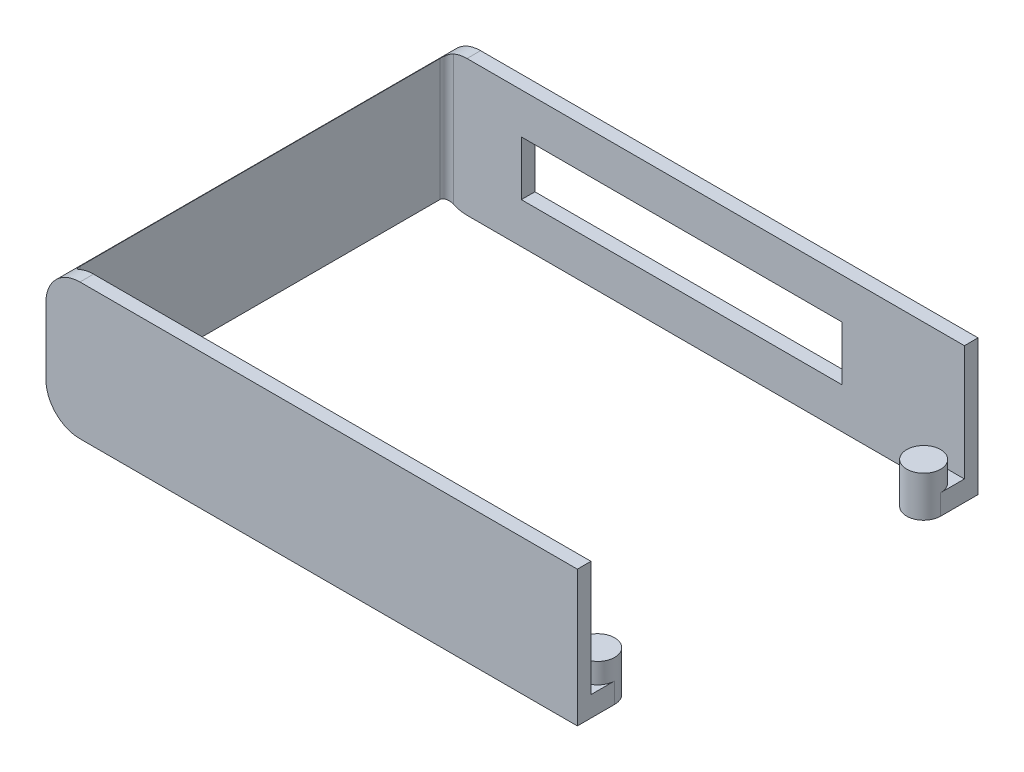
ISO-10303-21;
HEADER;
FILE_DESCRIPTION(('STEP AP214'),'2;1');
FILE_NAME('part.step','',(''),(''),'','','');
FILE_SCHEMA(('AUTOMOTIVE_DESIGN { 1 0 10303 214 1 1 1 1 }'));
ENDSEC;
DATA;
#1=APPLICATION_CONTEXT('core data for automotive mechanical design processes');
#2=APPLICATION_PROTOCOL_DEFINITION('international standard','automotive_design',2000,#1);
#3=PRODUCT_CONTEXT('',#1,'mechanical');
#4=PRODUCT('Part','Part','',(#3));
#5=PRODUCT_RELATED_PRODUCT_CATEGORY('part','',(#4));
#6=PRODUCT_DEFINITION_FORMATION('','',#4);
#7=PRODUCT_DEFINITION_CONTEXT('part definition',#1,'design');
#8=PRODUCT_DEFINITION('design','',#6,#7);
#9=PRODUCT_DEFINITION_SHAPE('','',#8);
#10=(LENGTH_UNIT() NAMED_UNIT(*) SI_UNIT(.MILLI.,.METRE.));
#11=(NAMED_UNIT(*) PLANE_ANGLE_UNIT() SI_UNIT($,.RADIAN.));
#12=(NAMED_UNIT(*) SI_UNIT($,.STERADIAN.) SOLID_ANGLE_UNIT());
#13=UNCERTAINTY_MEASURE_WITH_UNIT(LENGTH_MEASURE(1.E-05),#10,'distance_accuracy_value','');
#14=(GEOMETRIC_REPRESENTATION_CONTEXT(3) GLOBAL_UNCERTAINTY_ASSIGNED_CONTEXT((#13)) GLOBAL_UNIT_ASSIGNED_CONTEXT((#10,
#11,#12)) REPRESENTATION_CONTEXT('',''));
#15=CARTESIAN_POINT('',(0.,0.,0.));
#16=DIRECTION('',(0.,0.,1.));
#17=DIRECTION('',(1.,0.,0.));
#18=AXIS2_PLACEMENT_3D('',#15,#16,#17);
#19=CARTESIAN_POINT('',(-39.125,0.,2.));
#20=DIRECTION('',(0.,1.,0.));
#21=DIRECTION('',(0.,0.,1.));
#22=AXIS2_PLACEMENT_3D('',#19,#20,#21);
#23=PLANE('',#22);
#24=DIRECTION('',(1.,0.,0.));
#25=VECTOR('',#24,1.);
#26=CARTESIAN_POINT('',(-39.125,0.,59.));
#27=LINE('',#26,#25);
#28=CARTESIAN_POINT('',(-34.125,0.,59.));
#29=VERTEX_POINT('',#28);
#30=CARTESIAN_POINT('',(39.125,0.,59.));
#31=VERTEX_POINT('',#30);
#32=EDGE_CURVE('E416',#29,#31,#27,.T.);
#33=ORIENTED_EDGE('',*,*,#32,.F.);
#34=DIRECTION('',(0.,0.,-1.));
#35=VECTOR('',#34,1.);
#36=CARTESIAN_POINT('',(-34.125,0.,2.));
#37=LINE('',#36,#35);
#38=CARTESIAN_POINT('',(-34.125,0.,57.));
#39=VERTEX_POINT('',#38);
#40=EDGE_CURVE('E270',#29,#39,#37,.T.);
#41=ORIENTED_EDGE('',*,*,#40,.T.);
#42=DIRECTION('',(1.,0.,0.));
#43=VECTOR('',#42,1.);
#44=CARTESIAN_POINT('',(-39.125,0.,57.));
#45=LINE('',#44,#43);
#46=CARTESIAN_POINT('',(34.125,0.,57.));
#47=VERTEX_POINT('',#46);
#48=EDGE_CURVE('E249',#39,#47,#45,.T.);
#49=ORIENTED_EDGE('',*,*,#48,.T.);
#50=DIRECTION('',(0.,0.,-1.));
#51=VECTOR('',#50,1.);
#52=CARTESIAN_POINT('',(34.125,0.,59.));
#53=LINE('',#52,#51);
#54=CARTESIAN_POINT('',(34.125,0.,53.5));
#55=VERTEX_POINT('',#54);
#56=EDGE_CURVE('E235',#47,#55,#53,.T.);
#57=ORIENTED_EDGE('',*,*,#56,.T.);
#58=CARTESIAN_POINT('',(36.625,0.,53.5));
#59=DIRECTION('',(0.,-1.,0.));
#60=DIRECTION('',(0.,0.,1.));
#61=AXIS2_PLACEMENT_3D('',#58,#59,#60);
#62=CIRCLE('',#61,2.5);
#63=CARTESIAN_POINT('',(39.125,0.,53.5));
#64=VERTEX_POINT('',#63);
#65=EDGE_CURVE('E232',#55,#64,#62,.T.);
#66=ORIENTED_EDGE('',*,*,#65,.T.);
#67=DIRECTION('',(0.,0.,-1.));
#68=VECTOR('',#67,1.);
#69=CARTESIAN_POINT('',(39.125,0.,59.));
#70=LINE('',#69,#68);
#71=EDGE_CURVE('E443',#31,#64,#70,.T.);
#72=ORIENTED_EDGE('',*,*,#71,.F.);
#73=EDGE_LOOP('',(#33,#41,#49,#57,#66,#72));
#74=FACE_BOUND('',#73,.T.);
#75=ADVANCED_FACE('F26',(#74),#23,.F.);
#76=CARTESIAN_POINT('',(-39.125,20.,2.));
#77=DIRECTION('',(0.,-1.,0.));
#78=DIRECTION('',(1.,0.,0.));
#79=AXIS2_PLACEMENT_3D('',#76,#77,#78);
#80=PLANE('',#79);
#81=DIRECTION('',(-1.,0.,0.));
#82=VECTOR('',#81,1.);
#83=CARTESIAN_POINT('',(-39.125,20.,0.));
#84=LINE('',#83,#82);
#85=CARTESIAN_POINT('',(39.125,20.,0.));
#86=VERTEX_POINT('',#85);
#87=CARTESIAN_POINT('',(-34.125,20.,0.));
#88=VERTEX_POINT('',#87);
#89=EDGE_CURVE('E362',#86,#88,#84,.T.);
#90=ORIENTED_EDGE('',*,*,#89,.T.);
#91=DIRECTION('',(0.,0.,-1.));
#92=VECTOR('',#91,1.);
#93=CARTESIAN_POINT('',(-34.125,20.,2.));
#94=LINE('',#93,#92);
#95=CARTESIAN_POINT('',(-34.125,20.,2.));
#96=VERTEX_POINT('',#95);
#97=EDGE_CURVE('E385',#88,#96,#94,.F.);
#98=ORIENTED_EDGE('',*,*,#97,.T.);
#99=DIRECTION('',(-1.,0.,0.));
#100=VECTOR('',#99,1.);
#101=CARTESIAN_POINT('',(-39.125,20.,2.));
#102=LINE('',#101,#100);
#103=CARTESIAN_POINT('',(39.125,20.,2.));
#104=VERTEX_POINT('',#103);
#105=EDGE_CURVE('E394',#104,#96,#102,.T.);
#106=ORIENTED_EDGE('',*,*,#105,.F.);
#107=DIRECTION('',(0.,0.,-1.));
#108=VECTOR('',#107,1.);
#109=CARTESIAN_POINT('',(39.125,20.,2.));
#110=LINE('',#109,#108);
#111=EDGE_CURVE('E397',#104,#86,#110,.T.);
#112=ORIENTED_EDGE('',*,*,#111,.T.);
#113=EDGE_LOOP('',(#90,#98,#106,#112));
#114=FACE_BOUND('',#113,.T.);
#115=ADVANCED_FACE('F328',(#114),#80,.F.);
#116=CARTESIAN_POINT('',(36.625,3.,5.5));
#117=DIRECTION('',(0.,-1.,0.));
#118=DIRECTION('',(0.,0.,-1.));
#119=AXIS2_PLACEMENT_3D('',#116,#117,#118);
#120=PLANE('',#119);
#121=CARTESIAN_POINT('',(36.625,3.,5.5));
#122=DIRECTION('',(0.,1.,0.));
#123=DIRECTION('',(0.,0.,1.));
#124=AXIS2_PLACEMENT_3D('',#121,#122,#123);
#125=CIRCLE('',#124,2.5);
#126=CARTESIAN_POINT('',(39.125,3.,5.5));
#127=VERTEX_POINT('',#126);
#128=CARTESIAN_POINT('',(34.125,3.,5.5));
#129=VERTEX_POINT('',#128);
#130=EDGE_CURVE('E446',#127,#129,#125,.T.);
#131=ORIENTED_EDGE('',*,*,#130,.F.);
#132=DIRECTION('',(0.,0.,-1.));
#133=VECTOR('',#132,1.);
#134=CARTESIAN_POINT('',(39.125,3.,0.));
#135=LINE('',#134,#133);
#136=CARTESIAN_POINT('',(39.125,3.,2.));
#137=VERTEX_POINT('',#136);
#138=EDGE_CURVE('E721',#127,#137,#135,.T.);
#139=ORIENTED_EDGE('',*,*,#138,.T.);
#140=DIRECTION('',(1.,0.,0.));
#141=VECTOR('',#140,1.);
#142=CARTESIAN_POINT('',(-39.125,3.,2.));
#143=LINE('',#142,#141);
#144=CARTESIAN_POINT('',(34.125,3.,2.));
#145=VERTEX_POINT('',#144);
#146=EDGE_CURVE('E475',#145,#137,#143,.T.);
#147=ORIENTED_EDGE('',*,*,#146,.F.);
#148=DIRECTION('',(0.,0.,1.));
#149=VECTOR('',#148,1.);
#150=CARTESIAN_POINT('',(34.125,3.,0.));
#151=LINE('',#150,#149);
#152=EDGE_CURVE('E724',#145,#129,#151,.T.);
#153=ORIENTED_EDGE('',*,*,#152,.T.);
#154=EDGE_LOOP('',(#131,#139,#147,#153));
#155=FACE_BOUND('',#154,.T.);
#156=ADVANCED_FACE('F335',(#155),#120,.F.);
#157=CARTESIAN_POINT('',(-39.125,0.,2.));
#158=DIRECTION('',(0.,0.,1.));
#159=DIRECTION('',(1.,0.,0.));
#160=AXIS2_PLACEMENT_3D('',#157,#158,#159);
#161=PLANE('',#160);
#162=DIRECTION('',(0.,-1.,0.));
#163=VECTOR('',#162,1.);
#164=CARTESIAN_POINT('',(21.124999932,14.,2.));
#165=LINE('',#164,#163);
#166=CARTESIAN_POINT('',(21.124999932,14.,2.));
#167=VERTEX_POINT('',#166);
#168=CARTESIAN_POINT('',(21.124999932,5.99999999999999,2.));
#169=VERTEX_POINT('',#168);
#170=EDGE_CURVE('E194',#167,#169,#165,.T.);
#171=ORIENTED_EDGE('',*,*,#170,.T.);
#172=DIRECTION('',(-1.,0.,0.));
#173=VECTOR('',#172,1.);
#174=CARTESIAN_POINT('',(21.124999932,5.99999999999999,2.));
#175=LINE('',#174,#173);
#176=CARTESIAN_POINT('',(-26.125,5.99999999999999,2.));
#177=VERTEX_POINT('',#176);
#178=EDGE_CURVE('E217',#169,#177,#175,.T.);
#179=ORIENTED_EDGE('',*,*,#178,.T.);
#180=DIRECTION('',(0.,1.,0.));
#181=VECTOR('',#180,1.);
#182=CARTESIAN_POINT('',(-26.125,14.,2.));
#183=LINE('',#182,#181);
#184=CARTESIAN_POINT('',(-26.125,14.,2.));
#185=VERTEX_POINT('',#184);
#186=EDGE_CURVE('E197',#177,#185,#183,.T.);
#187=ORIENTED_EDGE('',*,*,#186,.T.);
#188=DIRECTION('',(1.,0.,0.));
#189=VECTOR('',#188,1.);
#190=CARTESIAN_POINT('',(21.124999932,14.,2.));
#191=LINE('',#190,#189);
#192=EDGE_CURVE('E198',#185,#167,#191,.T.);
#193=ORIENTED_EDGE('',*,*,#192,.T.);
#194=EDGE_LOOP('',(#171,#179,#187,#193));
#195=FACE_BOUND('',#194,.T.);
#196=CARTESIAN_POINT('',(-34.125,15.,2.));
#197=DIRECTION('',(0.,0.,1.));
#198=DIRECTION('',(1.,0.,0.));
#199=AXIS2_PLACEMENT_3D('',#196,#197,#198);
#200=CIRCLE('',#199,5.);
#201=CARTESIAN_POINT('',(-36.125,19.5825756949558,2.));
#202=VERTEX_POINT('',#201);
#203=EDGE_CURVE('E484',#96,#202,#200,.T.);
#204=ORIENTED_EDGE('',*,*,#203,.T.);
#205=DIRECTION('',(0.,1.,0.));
#206=VECTOR('',#205,1.);
#207=CARTESIAN_POINT('',(-36.125,0.,2.));
#208=LINE('',#207,#206);
#209=CARTESIAN_POINT('',(-36.125,0.417424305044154,2.));
#210=VERTEX_POINT('',#209);
#211=EDGE_CURVE('E281',#202,#210,#208,.F.);
#212=ORIENTED_EDGE('',*,*,#211,.T.);
#213=CARTESIAN_POINT('',(-34.125,5.,2.));
#214=DIRECTION('',(0.,0.,1.));
#215=DIRECTION('',(1.,0.,0.));
#216=AXIS2_PLACEMENT_3D('',#213,#214,#215);
#217=CIRCLE('',#216,5.);
#218=CARTESIAN_POINT('',(-34.125,0.,2.));
#219=VERTEX_POINT('',#218);
#220=EDGE_CURVE('E368',#210,#219,#217,.T.);
#221=ORIENTED_EDGE('',*,*,#220,.T.);
#222=DIRECTION('',(1.,0.,0.));
#223=VECTOR('',#222,1.);
#224=CARTESIAN_POINT('',(-39.125,0.,2.));
#225=LINE('',#224,#223);
#226=CARTESIAN_POINT('',(34.125,0.,2.));
#227=VERTEX_POINT('',#226);
#228=EDGE_CURVE('E354',#219,#227,#225,.T.);
#229=ORIENTED_EDGE('',*,*,#228,.T.);
#230=DIRECTION('',(0.,1.,0.));
#231=VECTOR('',#230,1.);
#232=CARTESIAN_POINT('',(34.125,0.,2.));
#233=LINE('',#232,#231);
#234=EDGE_CURVE('E471',#227,#145,#233,.T.);
#235=ORIENTED_EDGE('',*,*,#234,.T.);
#236=ORIENTED_EDGE('',*,*,#146,.T.);
#237=DIRECTION('',(0.,1.,0.));
#238=VECTOR('',#237,1.);
#239=CARTESIAN_POINT('',(39.125,20.,2.));
#240=LINE('',#239,#238);
#241=EDGE_CURVE('E361',#137,#104,#240,.T.);
#242=ORIENTED_EDGE('',*,*,#241,.T.);
#243=ORIENTED_EDGE('',*,*,#105,.T.);
#244=EDGE_LOOP('',(#204,#212,#221,#229,#235,#236,#242,#243));
#245=FACE_BOUND('',#244,.T.);
#246=ADVANCED_FACE('F350',(#195,#245),#161,.T.);
#247=CARTESIAN_POINT('',(-39.125,20.,2.));
#248=DIRECTION('',(1.,0.,0.));
#249=DIRECTION('',(0.,1.,0.));
#250=AXIS2_PLACEMENT_3D('',#247,#248,#249);
#251=PLANE('',#250);
#252=DIRECTION('',(0.,-1.,0.));
#253=VECTOR('',#252,1.);
#254=CARTESIAN_POINT('',(-39.125,0.,59.));
#255=LINE('',#254,#253);
#256=CARTESIAN_POINT('',(-39.125,15.,59.));
#257=VERTEX_POINT('',#256);
#258=CARTESIAN_POINT('',(-39.125,5.,59.));
#259=VERTEX_POINT('',#258);
#260=EDGE_CURVE('E409',#257,#259,#255,.T.);
#261=ORIENTED_EDGE('',*,*,#260,.F.);
#262=DIRECTION('',(0.,0.,-1.));
#263=VECTOR('',#262,1.);
#264=CARTESIAN_POINT('',(-39.125,15.,2.));
#265=LINE('',#264,#263);
#266=CARTESIAN_POINT('',(-39.125,15.,0.));
#267=VERTEX_POINT('',#266);
#268=EDGE_CURVE('E376',#257,#267,#265,.T.);
#269=ORIENTED_EDGE('',*,*,#268,.T.);
#270=DIRECTION('',(0.,-1.,0.));
#271=VECTOR('',#270,1.);
#272=CARTESIAN_POINT('',(-39.125,20.,0.));
#273=LINE('',#272,#271);
#274=CARTESIAN_POINT('',(-39.125,5.,0.));
#275=VERTEX_POINT('',#274);
#276=EDGE_CURVE('E411',#267,#275,#273,.T.);
#277=ORIENTED_EDGE('',*,*,#276,.T.);
#278=DIRECTION('',(0.,0.,-1.));
#279=VECTOR('',#278,1.);
#280=CARTESIAN_POINT('',(-39.125,5.,2.));
#281=LINE('',#280,#279);
#282=EDGE_CURVE('E372',#275,#259,#281,.F.);
#283=ORIENTED_EDGE('',*,*,#282,.T.);
#284=EDGE_LOOP('',(#261,#269,#277,#283));
#285=FACE_BOUND('',#284,.T.);
#286=ADVANCED_FACE('F28',(#285),#251,.F.);
#287=ORIENTED_EDGE('',*,*,#228,.F.);
#288=DIRECTION('',(0.,0.,-1.));
#289=VECTOR('',#288,1.);
#290=CARTESIAN_POINT('',(-34.125,0.,2.));
#291=LINE('',#290,#289);
#292=CARTESIAN_POINT('',(-34.125,0.,0.));
#293=VERTEX_POINT('',#292);
#294=EDGE_CURVE('E268',#219,#293,#291,.T.);
#295=ORIENTED_EDGE('',*,*,#294,.T.);
#296=DIRECTION('',(1.,0.,0.));
#297=VECTOR('',#296,1.);
#298=CARTESIAN_POINT('',(-39.125,0.,0.));
#299=LINE('',#298,#297);
#300=CARTESIAN_POINT('',(39.125,0.,0.));
#301=VERTEX_POINT('',#300);
#302=EDGE_CURVE('E470',#293,#301,#299,.T.);
#303=ORIENTED_EDGE('',*,*,#302,.T.);
#304=DIRECTION('',(0.,0.,-1.));
#305=VECTOR('',#304,1.);
#306=CARTESIAN_POINT('',(39.125,0.,2.));
#307=LINE('',#306,#305);
#308=CARTESIAN_POINT('',(39.125,0.,5.5));
#309=VERTEX_POINT('',#308);
#310=EDGE_CURVE('E402',#309,#301,#307,.T.);
#311=ORIENTED_EDGE('',*,*,#310,.F.);
#312=CARTESIAN_POINT('',(36.625,0.,5.5));
#313=DIRECTION('',(0.,1.,0.));
#314=DIRECTION('',(0.,0.,-1.));
#315=AXIS2_PLACEMENT_3D('',#312,#313,#314);
#316=CIRCLE('',#315,2.5);
#317=CARTESIAN_POINT('',(34.125,0.,5.5));
#318=VERTEX_POINT('',#317);
#319=EDGE_CURVE('E716',#318,#309,#316,.T.);
#320=ORIENTED_EDGE('',*,*,#319,.F.);
#321=DIRECTION('',(0.,0.,1.));
#322=VECTOR('',#321,1.);
#323=CARTESIAN_POINT('',(34.125,0.,0.));
#324=LINE('',#323,#322);
#325=EDGE_CURVE('E358',#227,#318,#324,.T.);
#326=ORIENTED_EDGE('',*,*,#325,.F.);
#327=EDGE_LOOP('',(#287,#295,#303,#311,#320,#326));
#328=FACE_BOUND('',#327,.T.);
#329=ADVANCED_FACE('F330',(#328),#23,.F.);
#330=CARTESIAN_POINT('',(39.125,20.,2.));
#331=DIRECTION('',(-1.,0.,0.));
#332=DIRECTION('',(0.,0.,1.));
#333=AXIS2_PLACEMENT_3D('',#330,#331,#332);
#334=PLANE('',#333);
#335=DIRECTION('',(0.,1.,0.));
#336=VECTOR('',#335,1.);
#337=CARTESIAN_POINT('',(39.125,20.,0.));
#338=LINE('',#337,#336);
#339=EDGE_CURVE('E473',#301,#86,#338,.T.);
#340=ORIENTED_EDGE('',*,*,#339,.T.);
#341=ORIENTED_EDGE('',*,*,#111,.F.);
#342=ORIENTED_EDGE('',*,*,#241,.F.);
#343=ORIENTED_EDGE('',*,*,#138,.F.);
#344=DIRECTION('',(0.,-1.,0.));
#345=VECTOR('',#344,1.);
#346=CARTESIAN_POINT('',(39.125,3.,5.5));
#347=LINE('',#346,#345);
#348=EDGE_CURVE('E727',#127,#309,#347,.T.);
#349=ORIENTED_EDGE('',*,*,#348,.T.);
#350=ORIENTED_EDGE('',*,*,#310,.T.);
#351=EDGE_LOOP('',(#340,#341,#342,#343,#349,#350));
#352=FACE_BOUND('',#351,.T.);
#353=ADVANCED_FACE('F342',(#352),#334,.F.);
#354=DIRECTION('',(-1.,0.,0.));
#355=VECTOR('',#354,1.);
#356=CARTESIAN_POINT('',(-39.125,20.,57.));
#357=LINE('',#356,#355);
#358=CARTESIAN_POINT('',(39.125,20.,57.));
#359=VERTEX_POINT('',#358);
#360=CARTESIAN_POINT('',(-34.125,20.,57.));
#361=VERTEX_POINT('',#360);
#362=EDGE_CURVE('E417',#359,#361,#357,.T.);
#363=ORIENTED_EDGE('',*,*,#362,.T.);
#364=DIRECTION('',(0.,0.,-1.));
#365=VECTOR('',#364,1.);
#366=CARTESIAN_POINT('',(-34.125,20.,2.));
#367=LINE('',#366,#365);
#368=CARTESIAN_POINT('',(-34.125,20.,59.));
#369=VERTEX_POINT('',#368);
#370=EDGE_CURVE('E378',#361,#369,#367,.F.);
#371=ORIENTED_EDGE('',*,*,#370,.T.);
#372=DIRECTION('',(-1.,0.,0.));
#373=VECTOR('',#372,1.);
#374=CARTESIAN_POINT('',(-39.125,20.,59.));
#375=LINE('',#374,#373);
#376=CARTESIAN_POINT('',(39.125,20.,59.));
#377=VERTEX_POINT('',#376);
#378=EDGE_CURVE('E453',#377,#369,#375,.T.);
#379=ORIENTED_EDGE('',*,*,#378,.F.);
#380=DIRECTION('',(0.,0.,-1.));
#381=VECTOR('',#380,1.);
#382=CARTESIAN_POINT('',(39.125,20.,59.));
#383=LINE('',#382,#381);
#384=EDGE_CURVE('E447',#377,#359,#383,.T.);
#385=ORIENTED_EDGE('',*,*,#384,.T.);
#386=EDGE_LOOP('',(#363,#371,#379,#385));
#387=FACE_BOUND('',#386,.T.);
#388=ADVANCED_FACE('F338',(#387),#80,.F.);
#389=CARTESIAN_POINT('',(-39.125,0.,0.));
#390=DIRECTION('',(0.,0.,1.));
#391=DIRECTION('',(1.,0.,0.));
#392=AXIS2_PLACEMENT_3D('',#389,#390,#391);
#393=PLANE('',#392);
#394=DIRECTION('',(-1.,0.,0.));
#395=VECTOR('',#394,1.);
#396=CARTESIAN_POINT('',(21.124999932,5.99999999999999,0.));
#397=LINE('',#396,#395);
#398=CARTESIAN_POINT('',(21.124999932,5.99999999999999,0.));
#399=VERTEX_POINT('',#398);
#400=CARTESIAN_POINT('',(-26.125,5.99999999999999,0.));
#401=VERTEX_POINT('',#400);
#402=EDGE_CURVE('E214',#399,#401,#397,.T.);
#403=ORIENTED_EDGE('',*,*,#402,.F.);
#404=DIRECTION('',(0.,-1.,0.));
#405=VECTOR('',#404,1.);
#406=CARTESIAN_POINT('',(21.124999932,14.,0.));
#407=LINE('',#406,#405);
#408=CARTESIAN_POINT('',(21.124999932,14.,0.));
#409=VERTEX_POINT('',#408);
#410=EDGE_CURVE('E54',#409,#399,#407,.T.);
#411=ORIENTED_EDGE('',*,*,#410,.F.);
#412=DIRECTION('',(1.,0.,0.));
#413=VECTOR('',#412,1.);
#414=CARTESIAN_POINT('',(21.124999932,14.,0.));
#415=LINE('',#414,#413);
#416=CARTESIAN_POINT('',(-26.125,14.,0.));
#417=VERTEX_POINT('',#416);
#418=EDGE_CURVE('E201',#417,#409,#415,.T.);
#419=ORIENTED_EDGE('',*,*,#418,.F.);
#420=DIRECTION('',(0.,1.,0.));
#421=VECTOR('',#420,1.);
#422=CARTESIAN_POINT('',(-26.125,14.,0.));
#423=LINE('',#422,#421);
#424=EDGE_CURVE('E209',#401,#417,#423,.T.);
#425=ORIENTED_EDGE('',*,*,#424,.F.);
#426=EDGE_LOOP('',(#403,#411,#419,#425));
#427=FACE_BOUND('',#426,.T.);
#428=ORIENTED_EDGE('',*,*,#276,.F.);
#429=CARTESIAN_POINT('',(-34.125,15.,0.));
#430=DIRECTION('',(0.,0.,1.));
#431=DIRECTION('',(1.,0.,0.));
#432=AXIS2_PLACEMENT_3D('',#429,#430,#431);
#433=CIRCLE('',#432,5.);
#434=EDGE_CURVE('E375',#267,#88,#433,.F.);
#435=ORIENTED_EDGE('',*,*,#434,.T.);
#436=ORIENTED_EDGE('',*,*,#89,.F.);
#437=ORIENTED_EDGE('',*,*,#339,.F.);
#438=ORIENTED_EDGE('',*,*,#302,.F.);
#439=CARTESIAN_POINT('',(-34.125,5.,0.));
#440=DIRECTION('',(0.,0.,1.));
#441=DIRECTION('',(1.,0.,0.));
#442=AXIS2_PLACEMENT_3D('',#439,#440,#441);
#443=CIRCLE('',#442,5.);
#444=EDGE_CURVE('E371',#293,#275,#443,.F.);
#445=ORIENTED_EDGE('',*,*,#444,.T.);
#446=EDGE_LOOP('',(#428,#435,#436,#437,#438,#445));
#447=FACE_BOUND('',#446,.T.);
#448=ADVANCED_FACE('F212',(#427,#447),#393,.F.);
#449=CARTESIAN_POINT('',(-37.125,20.,29.5));
#450=DIRECTION('',(-1.,0.,0.));
#451=DIRECTION('',(0.,0.,1.));
#452=AXIS2_PLACEMENT_3D('',#449,#450,#451);
#453=PLANE('',#452);
#454=DIRECTION('',(0.,0.,-1.));
#455=VECTOR('',#454,1.);
#456=CARTESIAN_POINT('',(-37.125,19.,2.));
#457=LINE('',#456,#455);
#458=CARTESIAN_POINT('',(-37.125,19.,3.));
#459=VERTEX_POINT('',#458);
#460=CARTESIAN_POINT('',(-37.125,19.,56.));
#461=VERTEX_POINT('',#460);
#462=EDGE_CURVE('E257',#459,#461,#457,.F.);
#463=ORIENTED_EDGE('',*,*,#462,.T.);
#464=DIRECTION('',(0.,1.,0.));
#465=VECTOR('',#464,1.);
#466=CARTESIAN_POINT('',(-37.125,20.,56.));
#467=LINE('',#466,#465);
#468=CARTESIAN_POINT('',(-37.125,0.999999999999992,56.));
#469=VERTEX_POINT('',#468);
#470=EDGE_CURVE('E279',#461,#469,#467,.F.);
#471=ORIENTED_EDGE('',*,*,#470,.T.);
#472=DIRECTION('',(0.,0.,-1.));
#473=VECTOR('',#472,1.);
#474=CARTESIAN_POINT('',(-37.125,0.999999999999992,57.));
#475=LINE('',#474,#473);
#476=CARTESIAN_POINT('',(-37.125,0.999999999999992,3.));
#477=VERTEX_POINT('',#476);
#478=EDGE_CURVE('E487',#469,#477,#475,.T.);
#479=ORIENTED_EDGE('',*,*,#478,.T.);
#480=DIRECTION('',(0.,1.,0.));
#481=VECTOR('',#480,1.);
#482=CARTESIAN_POINT('',(-37.125,20.,3.));
#483=LINE('',#482,#481);
#484=EDGE_CURVE('E276',#477,#459,#483,.T.);
#485=ORIENTED_EDGE('',*,*,#484,.T.);
#486=EDGE_LOOP('',(#463,#471,#479,#485));
#487=FACE_BOUND('',#486,.T.);
#488=ADVANCED_FACE('F494',(#487),#453,.F.);
#489=CARTESIAN_POINT('',(34.125,3.,0.));
#490=DIRECTION('',(1.,0.,0.));
#491=DIRECTION('',(0.,0.,-1.));
#492=AXIS2_PLACEMENT_3D('',#489,#490,#491);
#493=PLANE('',#492);
#494=ORIENTED_EDGE('',*,*,#234,.F.);
#495=ORIENTED_EDGE('',*,*,#325,.T.);
#496=DIRECTION('',(0.,-1.,0.));
#497=VECTOR('',#496,1.);
#498=CARTESIAN_POINT('',(34.125,3.,5.5));
#499=LINE('',#498,#497);
#500=EDGE_CURVE('E730',#129,#318,#499,.T.);
#501=ORIENTED_EDGE('',*,*,#500,.F.);
#502=ORIENTED_EDGE('',*,*,#152,.F.);
#503=EDGE_LOOP('',(#494,#495,#501,#502));
#504=FACE_BOUND('',#503,.T.);
#505=ADVANCED_FACE('F509',(#504),#493,.F.);
#506=CARTESIAN_POINT('',(36.625,3.,5.5));
#507=DIRECTION('',(0.,-1.,0.));
#508=DIRECTION('',(0.,0.,-1.));
#509=AXIS2_PLACEMENT_3D('',#506,#507,#508);
#510=CYLINDRICAL_SURFACE('',#509,2.5);
#511=ORIENTED_EDGE('',*,*,#319,.T.);
#512=ORIENTED_EDGE('',*,*,#348,.F.);
#513=ORIENTED_EDGE('',*,*,#130,.T.);
#514=ORIENTED_EDGE('',*,*,#500,.T.);
#515=EDGE_LOOP('',(#511,#512,#513,#514));
#516=FACE_BOUND('',#515,.T.);
#517=CARTESIAN_POINT('',(36.625,6.,5.5));
#518=DIRECTION('',(0.,1.,0.));
#519=DIRECTION('',(0.,0.,1.));
#520=AXIS2_PLACEMENT_3D('',#517,#518,#519);
#521=CIRCLE('',#520,2.5);
#522=CARTESIAN_POINT('',(36.625,6.,8.));
#523=VERTEX_POINT('',#522);
#524=EDGE_CURVE('E450',#523,#523,#521,.T.);
#525=ORIENTED_EDGE('',*,*,#524,.F.);
#526=EDGE_LOOP('',(#525));
#527=FACE_BOUND('',#526,.T.);
#528=ADVANCED_FACE('F512',(#516,#527),#510,.T.);
#529=CARTESIAN_POINT('',(36.625,6.,5.5));
#530=DIRECTION('',(0.,1.,0.));
#531=DIRECTION('',(0.,0.,1.));
#532=AXIS2_PLACEMENT_3D('',#529,#530,#531);
#533=PLANE('',#532);
#534=ORIENTED_EDGE('',*,*,#524,.T.);
#535=EDGE_LOOP('',(#534));
#536=FACE_BOUND('',#535,.T.);
#537=ADVANCED_FACE('F516',(#536),#533,.T.);
#538=CARTESIAN_POINT('',(39.125,0.,59.));
#539=DIRECTION('',(-1.,0.,0.));
#540=DIRECTION('',(0.,0.,1.));
#541=AXIS2_PLACEMENT_3D('',#538,#539,#540);
#542=PLANE('',#541);
#543=ORIENTED_EDGE('',*,*,#71,.T.);
#544=DIRECTION('',(0.,-1.,0.));
#545=VECTOR('',#544,1.);
#546=CARTESIAN_POINT('',(39.125,3.,53.5));
#547=LINE('',#546,#545);
#548=CARTESIAN_POINT('',(39.125,3.,53.5));
#549=VERTEX_POINT('',#548);
#550=EDGE_CURVE('E246',#549,#64,#547,.T.);
#551=ORIENTED_EDGE('',*,*,#550,.F.);
#552=DIRECTION('',(0.,0.,1.));
#553=VECTOR('',#552,1.);
#554=CARTESIAN_POINT('',(39.125,3.,59.));
#555=LINE('',#554,#553);
#556=CARTESIAN_POINT('',(39.125,3.,57.));
#557=VERTEX_POINT('',#556);
#558=EDGE_CURVE('E237',#549,#557,#555,.T.);
#559=ORIENTED_EDGE('',*,*,#558,.T.);
#560=DIRECTION('',(0.,1.,0.));
#561=VECTOR('',#560,1.);
#562=CARTESIAN_POINT('',(39.125,0.,57.));
#563=LINE('',#562,#561);
#564=EDGE_CURVE('E252',#557,#359,#563,.T.);
#565=ORIENTED_EDGE('',*,*,#564,.T.);
#566=ORIENTED_EDGE('',*,*,#384,.F.);
#567=DIRECTION('',(0.,1.,0.));
#568=VECTOR('',#567,1.);
#569=CARTESIAN_POINT('',(39.125,0.,59.));
#570=LINE('',#569,#568);
#571=EDGE_CURVE('E445',#31,#377,#570,.T.);
#572=ORIENTED_EDGE('',*,*,#571,.F.);
#573=EDGE_LOOP('',(#543,#551,#559,#565,#566,#572));
#574=FACE_BOUND('',#573,.T.);
#575=ADVANCED_FACE('F441',(#574),#542,.F.);
#576=CARTESIAN_POINT('',(-39.125,20.,59.));
#577=DIRECTION('',(0.,0.,-1.));
#578=DIRECTION('',(-1.,0.,0.));
#579=AXIS2_PLACEMENT_3D('',#576,#577,#578);
#580=PLANE('',#579);
#581=ORIENTED_EDGE('',*,*,#378,.T.);
#582=CARTESIAN_POINT('',(-34.125,15.,59.));
#583=DIRECTION('',(0.,0.,-1.));
#584=DIRECTION('',(-1.,0.,0.));
#585=AXIS2_PLACEMENT_3D('',#582,#583,#584);
#586=CIRCLE('',#585,5.);
#587=EDGE_CURVE('E266',#369,#257,#586,.F.);
#588=ORIENTED_EDGE('',*,*,#587,.T.);
#589=ORIENTED_EDGE('',*,*,#260,.T.);
#590=CARTESIAN_POINT('',(-34.125,5.,59.));
#591=DIRECTION('',(0.,0.,-1.));
#592=DIRECTION('',(-1.,0.,0.));
#593=AXIS2_PLACEMENT_3D('',#590,#591,#592);
#594=CIRCLE('',#593,5.);
#595=EDGE_CURVE('E264',#259,#29,#594,.F.);
#596=ORIENTED_EDGE('',*,*,#595,.T.);
#597=ORIENTED_EDGE('',*,*,#32,.T.);
#598=ORIENTED_EDGE('',*,*,#571,.T.);
#599=EDGE_LOOP('',(#581,#588,#589,#596,#597,#598));
#600=FACE_BOUND('',#599,.T.);
#601=ADVANCED_FACE('F414',(#600),#580,.F.);
#602=CARTESIAN_POINT('',(-39.125,20.,57.));
#603=DIRECTION('',(0.,0.,-1.));
#604=DIRECTION('',(-1.,0.,0.));
#605=AXIS2_PLACEMENT_3D('',#602,#603,#604);
#606=PLANE('',#605);
#607=CARTESIAN_POINT('',(-34.125,5.,57.));
#608=DIRECTION('',(0.,0.,-1.));
#609=DIRECTION('',(-1.,0.,0.));
#610=AXIS2_PLACEMENT_3D('',#607,#608,#609);
#611=CIRCLE('',#610,5.);
#612=CARTESIAN_POINT('',(-36.125,0.417424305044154,57.));
#613=VERTEX_POINT('',#612);
#614=EDGE_CURVE('E259',#39,#613,#611,.T.);
#615=ORIENTED_EDGE('',*,*,#614,.T.);
#616=DIRECTION('',(0.,1.,0.));
#617=VECTOR('',#616,1.);
#618=CARTESIAN_POINT('',(-36.125,20.,57.));
#619=LINE('',#618,#617);
#620=CARTESIAN_POINT('',(-36.125,19.5825756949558,57.));
#621=VERTEX_POINT('',#620);
#622=EDGE_CURVE('E273',#613,#621,#619,.T.);
#623=ORIENTED_EDGE('',*,*,#622,.T.);
#624=CARTESIAN_POINT('',(-34.125,15.,57.));
#625=DIRECTION('',(0.,0.,-1.));
#626=DIRECTION('',(-1.,0.,0.));
#627=AXIS2_PLACEMENT_3D('',#624,#625,#626);
#628=CIRCLE('',#627,5.);
#629=EDGE_CURVE('E262',#621,#361,#628,.T.);
#630=ORIENTED_EDGE('',*,*,#629,.T.);
#631=ORIENTED_EDGE('',*,*,#362,.F.);
#632=ORIENTED_EDGE('',*,*,#564,.F.);
#633=DIRECTION('',(-1.,0.,0.));
#634=VECTOR('',#633,1.);
#635=CARTESIAN_POINT('',(-39.125,3.,57.));
#636=LINE('',#635,#634);
#637=CARTESIAN_POINT('',(34.125,3.,57.));
#638=VERTEX_POINT('',#637);
#639=EDGE_CURVE('E403',#557,#638,#636,.T.);
#640=ORIENTED_EDGE('',*,*,#639,.T.);
#641=DIRECTION('',(0.,1.,0.));
#642=VECTOR('',#641,1.);
#643=CARTESIAN_POINT('',(34.125,20.,57.));
#644=LINE('',#643,#642);
#645=EDGE_CURVE('E406',#47,#638,#644,.T.);
#646=ORIENTED_EDGE('',*,*,#645,.F.);
#647=ORIENTED_EDGE('',*,*,#48,.F.);
#648=EDGE_LOOP('',(#615,#623,#630,#631,#632,#640,#646,#647));
#649=FACE_BOUND('',#648,.T.);
#650=ADVANCED_FACE('F425',(#649),#606,.T.);
#651=CARTESIAN_POINT('',(36.625,3.,53.5));
#652=DIRECTION('',(0.,-1.,0.));
#653=DIRECTION('',(0.,0.,-1.));
#654=AXIS2_PLACEMENT_3D('',#651,#652,#653);
#655=CYLINDRICAL_SURFACE('',#654,2.5);
#656=ORIENTED_EDGE('',*,*,#65,.F.);
#657=DIRECTION('',(0.,-1.,0.));
#658=VECTOR('',#657,1.);
#659=CARTESIAN_POINT('',(34.125,3.,53.5));
#660=LINE('',#659,#658);
#661=CARTESIAN_POINT('',(34.125,3.,53.5));
#662=VERTEX_POINT('',#661);
#663=EDGE_CURVE('E243',#662,#55,#660,.T.);
#664=ORIENTED_EDGE('',*,*,#663,.F.);
#665=CARTESIAN_POINT('',(36.625,3.,53.5));
#666=DIRECTION('',(0.,-1.,0.));
#667=DIRECTION('',(0.,0.,-1.));
#668=AXIS2_PLACEMENT_3D('',#665,#666,#667);
#669=CIRCLE('',#668,2.5);
#670=EDGE_CURVE('E208',#549,#662,#669,.T.);
#671=ORIENTED_EDGE('',*,*,#670,.F.);
#672=ORIENTED_EDGE('',*,*,#550,.T.);
#673=EDGE_LOOP('',(#656,#664,#671,#672));
#674=FACE_BOUND('',#673,.T.);
#675=CARTESIAN_POINT('',(36.625,6.,53.5));
#676=DIRECTION('',(0.,-1.,0.));
#677=DIRECTION('',(0.,0.,-1.));
#678=AXIS2_PLACEMENT_3D('',#675,#676,#677);
#679=CIRCLE('',#678,2.5);
#680=CARTESIAN_POINT('',(36.625,6.,51.));
#681=VERTEX_POINT('',#680);
#682=EDGE_CURVE('E229',#681,#681,#679,.T.);
#683=ORIENTED_EDGE('',*,*,#682,.T.);
#684=EDGE_LOOP('',(#683));
#685=FACE_BOUND('',#684,.T.);
#686=ADVANCED_FACE('F438',(#674,#685),#655,.T.);
#687=CARTESIAN_POINT('',(34.125,3.,59.));
#688=DIRECTION('',(-1.,0.,0.));
#689=DIRECTION('',(0.,0.,1.));
#690=AXIS2_PLACEMENT_3D('',#687,#688,#689);
#691=PLANE('',#690);
#692=ORIENTED_EDGE('',*,*,#56,.F.);
#693=ORIENTED_EDGE('',*,*,#645,.T.);
#694=DIRECTION('',(0.,0.,-1.));
#695=VECTOR('',#694,1.);
#696=CARTESIAN_POINT('',(34.125,3.,59.));
#697=LINE('',#696,#695);
#698=EDGE_CURVE('E240',#638,#662,#697,.T.);
#699=ORIENTED_EDGE('',*,*,#698,.T.);
#700=ORIENTED_EDGE('',*,*,#663,.T.);
#701=EDGE_LOOP('',(#692,#693,#699,#700));
#702=FACE_BOUND('',#701,.T.);
#703=ADVANCED_FACE('F430',(#702),#691,.T.);
#704=CARTESIAN_POINT('',(36.625,3.,53.5));
#705=DIRECTION('',(0.,-1.,0.));
#706=DIRECTION('',(0.,0.,1.));
#707=AXIS2_PLACEMENT_3D('',#704,#705,#706);
#708=PLANE('',#707);
#709=ORIENTED_EDGE('',*,*,#558,.F.);
#710=ORIENTED_EDGE('',*,*,#670,.T.);
#711=ORIENTED_EDGE('',*,*,#698,.F.);
#712=ORIENTED_EDGE('',*,*,#639,.F.);
#713=EDGE_LOOP('',(#709,#710,#711,#712));
#714=FACE_BOUND('',#713,.T.);
#715=ADVANCED_FACE('F434',(#714),#708,.F.);
#716=CARTESIAN_POINT('',(36.625,6.,53.5));
#717=DIRECTION('',(0.,1.,0.));
#718=DIRECTION('',(0.,0.,-1.));
#719=AXIS2_PLACEMENT_3D('',#716,#717,#718);
#720=PLANE('',#719);
#721=ORIENTED_EDGE('',*,*,#682,.F.);
#722=EDGE_LOOP('',(#721));
#723=FACE_BOUND('',#722,.T.);
#724=ADVANCED_FACE('F301',(#723),#720,.T.);
#725=CARTESIAN_POINT('',(-34.125,15.,2.));
#726=DIRECTION('',(0.,0.,-1.));
#727=DIRECTION('',(-1.,0.,0.));
#728=AXIS2_PLACEMENT_3D('',#725,#726,#727);
#729=CYLINDRICAL_SURFACE('',#728,5.);
#730=ORIENTED_EDGE('',*,*,#203,.F.);
#731=ORIENTED_EDGE('',*,*,#97,.F.);
#732=ORIENTED_EDGE('',*,*,#434,.F.);
#733=ORIENTED_EDGE('',*,*,#268,.F.);
#734=ORIENTED_EDGE('',*,*,#587,.F.);
#735=ORIENTED_EDGE('',*,*,#370,.F.);
#736=ORIENTED_EDGE('',*,*,#629,.F.);
#737=CARTESIAN_POINT('',(-36.125,19.5825756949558,57.));
#738=CARTESIAN_POINT('',(-36.1564177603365,19.5688660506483,56.9999984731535));
#739=CARTESIAN_POINT('',(-36.1876724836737,19.5548381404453,56.9985190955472));
#740=CARTESIAN_POINT('',(-36.2496553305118,19.5262568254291,56.99268865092));
#741=CARTESIAN_POINT('',(-36.2803836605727,19.5117036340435,56.9883387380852));
#742=CARTESIAN_POINT('',(-36.3713720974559,19.4674756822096,56.9711345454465));
#743=CARTESIAN_POINT('',(-36.4305864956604,19.4371664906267,56.9541249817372));
#744=CARTESIAN_POINT('',(-36.544572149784,19.376055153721,56.909780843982));
#745=CARTESIAN_POINT('',(-36.5993490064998,19.3452536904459,56.8824595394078));
#746=CARTESIAN_POINT('',(-36.7034019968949,19.2843295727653,56.8180448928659));
#747=CARTESIAN_POINT('',(-36.752670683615,19.2542078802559,56.7809385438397));
#748=CARTESIAN_POINT('',(-36.8452877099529,19.1956052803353,56.6965627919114));
#749=CARTESIAN_POINT('',(-36.8884824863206,19.1671748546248,56.6490883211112));
#750=CARTESIAN_POINT('',(-36.9658260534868,19.1148373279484,56.5451454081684));
#751=CARTESIAN_POINT('',(-36.9999951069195,19.0909201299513,56.4886975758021));
#752=CARTESIAN_POINT('',(-37.0485434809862,19.0562914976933,56.3863215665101));
#753=CARTESIAN_POINT('',(-37.0657834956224,19.0437724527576,56.3423490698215));
#754=CARTESIAN_POINT('',(-37.0940142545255,19.023091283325,56.2515133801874));
#755=CARTESIAN_POINT('',(-37.1050197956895,19.0149188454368,56.2046573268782));
#756=CARTESIAN_POINT('',(-37.1167069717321,19.0062095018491,56.1311656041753));
#757=CARTESIAN_POINT('',(-37.1198083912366,19.0038898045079,56.1050978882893));
#758=CARTESIAN_POINT('',(-37.1239574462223,19.0007820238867,56.0526924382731));
#759=CARTESIAN_POINT('',(-37.1250037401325,18.9999949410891,56.0263545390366));
#760=CARTESIAN_POINT('',(-37.125,19.,56.));
#761=B_SPLINE_CURVE_WITH_KNOTS('',3,(#737,#738,#739,#740,#741,#742,#743,#744,#745,#746,#747,
#748,#749,#750,#751,#752,#753,#754,#755,#756,#757,#758,#759,#760),.UNSPECIFIED.,.F.,.F.,(4,2,2,
2,2,2,2,2,2,2,2,4),(0.,0.10276204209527,0.205482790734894,0.410436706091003,0.615127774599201,
0.820092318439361,1.02955263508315,1.23853864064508,1.38454984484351,1.53021303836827,
1.60916135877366,1.68816119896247),.UNSPECIFIED.);
#762=EDGE_CURVE('E283',#621,#461,#761,.T.);
#763=ORIENTED_EDGE('',*,*,#762,.T.);
#764=ORIENTED_EDGE('',*,*,#462,.F.);
#765=CARTESIAN_POINT('',(-37.125,19.,3.));
#766=CARTESIAN_POINT('',(-37.1250024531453,18.9999965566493,2.97542760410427));
#767=CARTESIAN_POINT('',(-37.124093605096,19.0006799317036,2.9508695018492));
#768=CARTESIAN_POINT('',(-37.1204853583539,19.0033829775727,2.90197493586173));
#769=CARTESIAN_POINT('',(-37.1177871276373,19.0054017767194,2.8776383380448));
#770=CARTESIAN_POINT('',(-37.1071091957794,19.0133659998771,2.8055704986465));
#771=CARTESIAN_POINT('',(-37.0965451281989,19.0212204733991,2.75840090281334));
#772=CARTESIAN_POINT('',(-37.0691627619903,19.0413101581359,2.6670877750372));
#773=CARTESIAN_POINT('',(-37.0523586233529,19.053535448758,2.62293765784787));
#774=CARTESIAN_POINT('',(-37.0132517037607,19.081492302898,2.53827801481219));
#775=CARTESIAN_POINT('',(-36.9909398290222,19.0972296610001,2.49777466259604));
#776=CARTESIAN_POINT('',(-36.9393505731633,19.1328558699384,2.41749424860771));
#777=CARTESIAN_POINT('',(-36.9096245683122,19.1529919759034,2.37811737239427));
#778=CARTESIAN_POINT('',(-36.8454152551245,19.1953333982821,2.30474363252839));
#779=CARTESIAN_POINT('',(-36.8109300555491,19.2175395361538,2.27074891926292));
#780=CARTESIAN_POINT('',(-36.7310526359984,19.2674461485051,2.20253523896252));
#781=CARTESIAN_POINT('',(-36.684827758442,19.2953960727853,2.16946958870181));
#782=CARTESIAN_POINT('',(-36.5877175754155,19.3518022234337,2.11169329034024));
#783=CARTESIAN_POINT('',(-36.5368308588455,19.380258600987,2.08698518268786));
#784=CARTESIAN_POINT('',(-36.4275410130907,19.4387387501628,2.04494404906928));
#785=CARTESIAN_POINT('',(-36.3688604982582,19.4687278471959,2.02827015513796));
#786=CARTESIAN_POINT('',(-36.2787508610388,19.5124807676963,2.01141589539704));
#787=CARTESIAN_POINT('',(-36.248339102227,19.5268718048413,2.00715709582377));
#788=CARTESIAN_POINT('',(-36.1870050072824,19.5551375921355,2.00144953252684));
#789=CARTESIAN_POINT('',(-36.1560825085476,19.5690121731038,2.00000168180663));
#790=CARTESIAN_POINT('',(-36.125,19.5825756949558,2.));
#791=B_SPLINE_CURVE_WITH_KNOTS('',3,(#765,#766,#767,#768,#769,#770,#771,#772,#773,#774,#775,
#776,#777,#778,#779,#780,#781,#782,#783,#784,#785,#786,#787,#788,#789,#790),.UNSPECIFIED.,.F.,
.F.,(4,2,2,2,2,2,2,2,2,2,2,2,4),(0.,0.0736637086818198,0.147279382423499,0.293386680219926,
0.439164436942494,0.585184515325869,0.74446868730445,0.903816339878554,1.09304470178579,
1.28233053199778,1.48524562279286,1.58687821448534,1.68854381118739),.UNSPECIFIED.);
#792=EDGE_CURVE('E39',#459,#202,#791,.T.);
#793=ORIENTED_EDGE('',*,*,#792,.T.);
#794=EDGE_LOOP('',(#730,#731,#732,#733,#734,#735,#736,#763,#764,#793));
#795=FACE_BOUND('',#794,.T.);
#796=ADVANCED_FACE('F296',(#795),#729,.T.);
#797=CARTESIAN_POINT('',(-34.125,5.,2.));
#798=DIRECTION('',(0.,0.,-1.));
#799=DIRECTION('',(-1.,0.,0.));
#800=AXIS2_PLACEMENT_3D('',#797,#798,#799);
#801=CYLINDRICAL_SURFACE('',#800,5.);
#802=ORIENTED_EDGE('',*,*,#595,.F.);
#803=ORIENTED_EDGE('',*,*,#282,.F.);
#804=ORIENTED_EDGE('',*,*,#444,.F.);
#805=ORIENTED_EDGE('',*,*,#294,.F.);
#806=ORIENTED_EDGE('',*,*,#220,.F.);
#807=CARTESIAN_POINT('',(-36.125,0.417424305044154,2.));
#808=CARTESIAN_POINT('',(-36.1564177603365,0.4311339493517,2.00000152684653));
#809=CARTESIAN_POINT('',(-36.1876724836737,0.445161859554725,2.00148090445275));
#810=CARTESIAN_POINT('',(-36.2496553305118,0.473743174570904,2.00731134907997));
#811=CARTESIAN_POINT('',(-36.2803836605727,0.488296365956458,2.01166126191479));
#812=CARTESIAN_POINT('',(-36.3713720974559,0.532524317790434,2.02886545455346));
#813=CARTESIAN_POINT('',(-36.4305864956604,0.56283350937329,2.04587501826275));
#814=CARTESIAN_POINT('',(-36.544572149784,0.623944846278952,2.09021915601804));
#815=CARTESIAN_POINT('',(-36.5993490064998,0.654746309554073,2.11754046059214));
#816=CARTESIAN_POINT('',(-36.703401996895,0.715670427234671,2.18195510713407));
#817=CARTESIAN_POINT('',(-36.752670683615,0.745792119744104,2.21906145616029));
#818=CARTESIAN_POINT('',(-36.8452877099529,0.804394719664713,2.30343720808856));
#819=CARTESIAN_POINT('',(-36.8884824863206,0.832825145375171,2.35091167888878));
#820=CARTESIAN_POINT('',(-36.9658260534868,0.88516267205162,2.45485459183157));
#821=CARTESIAN_POINT('',(-36.9999951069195,0.909079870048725,2.51130242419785));
#822=CARTESIAN_POINT('',(-37.0485434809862,0.943708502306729,2.61367843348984));
#823=CARTESIAN_POINT('',(-37.0657834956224,0.956227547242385,2.65765093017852));
#824=CARTESIAN_POINT('',(-37.0940142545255,0.976908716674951,2.74848661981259));
#825=CARTESIAN_POINT('',(-37.1050197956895,0.985081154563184,2.79534267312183));
#826=CARTESIAN_POINT('',(-37.1167069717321,0.993790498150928,2.86883439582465));
#827=CARTESIAN_POINT('',(-37.1198083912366,0.99611019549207,2.89490211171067));
#828=CARTESIAN_POINT('',(-37.1239574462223,0.999217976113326,2.94730756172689));
#829=CARTESIAN_POINT('',(-37.1250037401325,1.00000505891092,2.97364546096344));
#830=CARTESIAN_POINT('',(-37.125,0.999999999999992,3.));
#831=B_SPLINE_CURVE_WITH_KNOTS('',3,(#807,#808,#809,#810,#811,#812,#813,#814,#815,#816,#817,
#818,#819,#820,#821,#822,#823,#824,#825,#826,#827,#828,#829,#830),.UNSPECIFIED.,.F.,.F.,(4,2,2,
2,2,2,2,2,2,2,2,4),(0.,0.10276204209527,0.205482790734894,0.410436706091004,0.615127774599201,
0.820092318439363,1.02955263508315,1.23853864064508,1.38454984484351,1.53021303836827,
1.60916135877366,1.68816119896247),.UNSPECIFIED.);
#832=EDGE_CURVE('E11',#210,#477,#831,.T.);
#833=ORIENTED_EDGE('',*,*,#832,.T.);
#834=ORIENTED_EDGE('',*,*,#478,.F.);
#835=CARTESIAN_POINT('',(-37.125,0.999999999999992,56.));
#836=CARTESIAN_POINT('',(-37.1250024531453,1.00000344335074,56.0245723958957));
#837=CARTESIAN_POINT('',(-37.124093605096,0.999320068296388,56.0491304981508));
#838=CARTESIAN_POINT('',(-37.1204853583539,0.996617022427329,56.0980250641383));
#839=CARTESIAN_POINT('',(-37.1177871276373,0.994598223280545,56.1223616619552));
#840=CARTESIAN_POINT('',(-37.1071091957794,0.98663400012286,56.1944295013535));
#841=CARTESIAN_POINT('',(-37.0965451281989,0.978779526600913,56.2415990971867));
#842=CARTESIAN_POINT('',(-37.0691627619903,0.958689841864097,56.3329122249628));
#843=CARTESIAN_POINT('',(-37.0523586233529,0.946464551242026,56.3770623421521));
#844=CARTESIAN_POINT('',(-37.0132517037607,0.918507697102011,56.4617219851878));
#845=CARTESIAN_POINT('',(-36.9909398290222,0.902770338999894,56.5022253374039));
#846=CARTESIAN_POINT('',(-36.9393505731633,0.867144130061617,56.5825057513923));
#847=CARTESIAN_POINT('',(-36.9096245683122,0.847008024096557,56.6218826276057));
#848=CARTESIAN_POINT('',(-36.8454152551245,0.804666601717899,56.6952563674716));
#849=CARTESIAN_POINT('',(-36.8109300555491,0.78246046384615,56.7292510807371));
#850=CARTESIAN_POINT('',(-36.7310526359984,0.732553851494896,56.7974647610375));
#851=CARTESIAN_POINT('',(-36.684827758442,0.704603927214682,56.8305304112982));
#852=CARTESIAN_POINT('',(-36.5877175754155,0.648197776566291,56.8883067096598));
#853=CARTESIAN_POINT('',(-36.5368308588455,0.619741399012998,56.9130148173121));
#854=CARTESIAN_POINT('',(-36.4275410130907,0.56126124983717,56.9550559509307));
#855=CARTESIAN_POINT('',(-36.3688604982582,0.531272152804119,56.971729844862));
#856=CARTESIAN_POINT('',(-36.2787508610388,0.487519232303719,56.988584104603));
#857=CARTESIAN_POINT('',(-36.248339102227,0.473128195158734,56.9928429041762));
#858=CARTESIAN_POINT('',(-36.1870050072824,0.444862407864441,56.9985504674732));
#859=CARTESIAN_POINT('',(-36.1560825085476,0.430987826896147,56.9999983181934));
#860=CARTESIAN_POINT('',(-36.125,0.417424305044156,57.));
#861=B_SPLINE_CURVE_WITH_KNOTS('',3,(#835,#836,#837,#838,#839,#840,#841,#842,#843,#844,#845,
#846,#847,#848,#849,#850,#851,#852,#853,#854,#855,#856,#857,#858,#859,#860),.UNSPECIFIED.,.F.,
.F.,(4,2,2,2,2,2,2,2,2,2,2,2,4),(0.,0.0736637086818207,0.147279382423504,0.293386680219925,
0.439164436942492,0.585184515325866,0.744468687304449,0.903816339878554,1.09304470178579,
1.28233053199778,1.48524562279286,1.58687821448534,1.68854381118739),.UNSPECIFIED.);
#862=EDGE_CURVE('E290',#469,#613,#861,.T.);
#863=ORIENTED_EDGE('',*,*,#862,.T.);
#864=ORIENTED_EDGE('',*,*,#614,.F.);
#865=ORIENTED_EDGE('',*,*,#40,.F.);
#866=EDGE_LOOP('',(#802,#803,#804,#805,#806,#833,#834,#863,#864,#865));
#867=FACE_BOUND('',#866,.T.);
#868=ADVANCED_FACE('F300',(#867),#801,.T.);
#869=CARTESIAN_POINT('',(-36.125,20.,56.));
#870=DIRECTION('',(0.,1.,0.));
#871=DIRECTION('',(0.,0.,1.));
#872=AXIS2_PLACEMENT_3D('',#869,#870,#871);
#873=CYLINDRICAL_SURFACE('',#872,1.);
#874=ORIENTED_EDGE('',*,*,#862,.F.);
#875=ORIENTED_EDGE('',*,*,#470,.F.);
#876=ORIENTED_EDGE('',*,*,#762,.F.);
#877=ORIENTED_EDGE('',*,*,#622,.F.);
#878=EDGE_LOOP('',(#874,#875,#876,#877));
#879=FACE_BOUND('',#878,.T.);
#880=ADVANCED_FACE('F294',(#879),#873,.F.);
#881=CARTESIAN_POINT('',(-36.125,20.,3.));
#882=DIRECTION('',(0.,1.,0.));
#883=DIRECTION('',(0.,0.,1.));
#884=AXIS2_PLACEMENT_3D('',#881,#882,#883);
#885=CYLINDRICAL_SURFACE('',#884,1.);
#886=ORIENTED_EDGE('',*,*,#832,.F.);
#887=ORIENTED_EDGE('',*,*,#211,.F.);
#888=ORIENTED_EDGE('',*,*,#792,.F.);
#889=ORIENTED_EDGE('',*,*,#484,.F.);
#890=EDGE_LOOP('',(#886,#887,#888,#889));
#891=FACE_BOUND('',#890,.T.);
#892=ADVANCED_FACE('F309',(#891),#885,.F.);
#893=CARTESIAN_POINT('',(21.124999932,14.,59.001));
#894=DIRECTION('',(1.,0.,0.));
#895=DIRECTION('',(0.,0.,-1.));
#896=AXIS2_PLACEMENT_3D('',#893,#894,#895);
#897=PLANE('',#896);
#898=DIRECTION('',(0.,0.,-1.));
#899=VECTOR('',#898,1.);
#900=CARTESIAN_POINT('',(21.124999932,14.,59.001));
#901=LINE('',#900,#899);
#902=EDGE_CURVE('E190',#167,#409,#901,.T.);
#903=ORIENTED_EDGE('',*,*,#902,.T.);
#904=ORIENTED_EDGE('',*,*,#410,.T.);
#905=DIRECTION('',(0.,0.,-1.));
#906=VECTOR('',#905,1.);
#907=CARTESIAN_POINT('',(21.124999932,5.99999999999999,59.001));
#908=LINE('',#907,#906);
#909=EDGE_CURVE('E222',#169,#399,#908,.T.);
#910=ORIENTED_EDGE('',*,*,#909,.F.);
#911=ORIENTED_EDGE('',*,*,#170,.F.);
#912=EDGE_LOOP('',(#903,#904,#910,#911));
#913=FACE_BOUND('',#912,.T.);
#914=ADVANCED_FACE('F192',(#913),#897,.F.);
#915=CARTESIAN_POINT('',(21.124999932,14.,59.001));
#916=DIRECTION('',(0.,1.,0.));
#917=DIRECTION('',(-1.,0.,0.));
#918=AXIS2_PLACEMENT_3D('',#915,#916,#917);
#919=PLANE('',#918);
#920=DIRECTION('',(0.,0.,-1.));
#921=VECTOR('',#920,1.);
#922=CARTESIAN_POINT('',(-26.125,14.,59.001));
#923=LINE('',#922,#921);
#924=EDGE_CURVE('E204',#185,#417,#923,.T.);
#925=ORIENTED_EDGE('',*,*,#924,.T.);
#926=ORIENTED_EDGE('',*,*,#418,.T.);
#927=ORIENTED_EDGE('',*,*,#902,.F.);
#928=ORIENTED_EDGE('',*,*,#192,.F.);
#929=EDGE_LOOP('',(#925,#926,#927,#928));
#930=FACE_BOUND('',#929,.T.);
#931=ADVANCED_FACE('F202',(#930),#919,.F.);
#932=CARTESIAN_POINT('',(-26.125,14.,59.001));
#933=DIRECTION('',(-1.,0.,0.));
#934=DIRECTION('',(0.,0.,1.));
#935=AXIS2_PLACEMENT_3D('',#932,#933,#934);
#936=PLANE('',#935);
#937=DIRECTION('',(0.,0.,-1.));
#938=VECTOR('',#937,1.);
#939=CARTESIAN_POINT('',(-26.125,5.99999999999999,59.001));
#940=LINE('',#939,#938);
#941=EDGE_CURVE('E46',#177,#401,#940,.T.);
#942=ORIENTED_EDGE('',*,*,#941,.T.);
#943=ORIENTED_EDGE('',*,*,#424,.T.);
#944=ORIENTED_EDGE('',*,*,#924,.F.);
#945=ORIENTED_EDGE('',*,*,#186,.F.);
#946=EDGE_LOOP('',(#942,#943,#944,#945));
#947=FACE_BOUND('',#946,.T.);
#948=ADVANCED_FACE('F319',(#947),#936,.F.);
#949=CARTESIAN_POINT('',(21.124999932,5.99999999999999,59.001));
#950=DIRECTION('',(0.,-1.,0.));
#951=DIRECTION('',(0.,0.,-1.));
#952=AXIS2_PLACEMENT_3D('',#949,#950,#951);
#953=PLANE('',#952);
#954=ORIENTED_EDGE('',*,*,#909,.T.);
#955=ORIENTED_EDGE('',*,*,#402,.T.);
#956=ORIENTED_EDGE('',*,*,#941,.F.);
#957=ORIENTED_EDGE('',*,*,#178,.F.);
#958=EDGE_LOOP('',(#954,#955,#956,#957));
#959=FACE_BOUND('',#958,.T.);
#960=ADVANCED_FACE('F322',(#959),#953,.F.);
#961=CLOSED_SHELL('',(#75,#115,#156,#246,#286,#329,#353,#388,#448,#488,#505,#528,#537,#575,#601,
#650,#686,#703,#715,#724,#796,#868,#880,#892,#914,#931,#948,#960));
#962=MANIFOLD_SOLID_BREP('B2',#961);
#963=ADVANCED_BREP_SHAPE_REPRESENTATION('',(#18,#962),#14);
#964=SHAPE_DEFINITION_REPRESENTATION(#9,#963);
ENDSEC;
END-ISO-10303-21;
